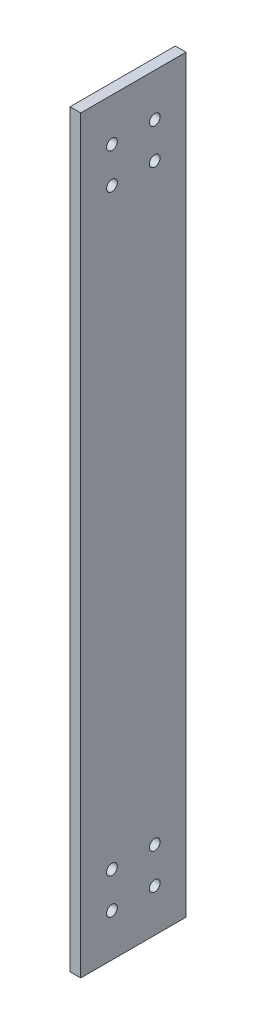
from build123d import *

# Parameters (mm, degrees)
SKETCH1_W           = 29.5
SKETCH1_H           = 210
BOSS_EXTRUDE1_DEPTH = 3
SKETCH2_R           = 1.5
CUT_EXTRUDE1_DEPTH  = 107.073382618


with BuildPart() as part:
    # Sketch1 → Boss-Extrude1 (new body)
    with BuildSketch(Plane(origin=(0, 0, 0), x_dir=(0, 0, -1), z_dir=(1, 0, 0))):
        Rectangle(SKETCH1_W, SKETCH1_H)
    extrude(amount=BOSS_EXTRUDE1_DEPTH)

    # Sketch2 → Cut-Extrude1 (cut, through all)
    with BuildSketch(Plane(origin=(3, 0, 0), x_dir=(0, 0, -1), z_dir=(1, 0, 0))):
        with Locations((6, 93)):
            Circle(SKETCH2_R)
        with Locations((6, 83)):
            Circle(SKETCH2_R)
        with Locations((-6, 93)):
            Circle(SKETCH2_R)
        with Locations((-6, 83)):
            Circle(SKETCH2_R)
        with Locations((6, -93)):
            Circle(SKETCH2_R)
        with Locations((6, -83)):
            Circle(SKETCH2_R)
        with Locations((-6, -83)):
            Circle(SKETCH2_R)
        with Locations((-6, -93)):
            Circle(SKETCH2_R)
    extrude(amount=-CUT_EXTRUDE1_DEPTH, mode=Mode.SUBTRACT)


solid = part.part
